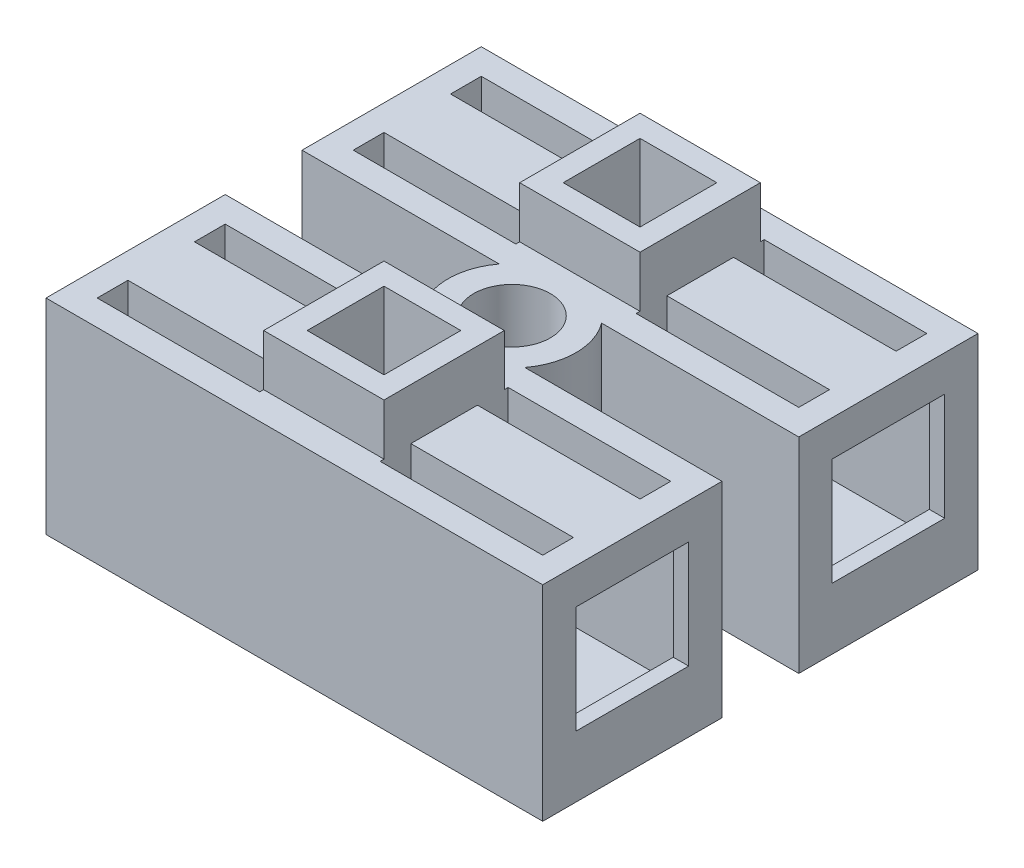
from build123d import *

# Parameters (mm, degrees)
SKETCH1_W                  = 19.4
SKETCH1_H                  = 7
BOSS_EXTRUDE1_DEPTH        = 4
SKETCH3_W                  = 5
SKETCH3_H                  = 5.6
METAL_BODY_PLACEMENT_DEPTH = 14.503332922
SKETCH9_W                  = 4.7
SKETCH9_H                  = 4.7
BOSS_EXTRUDE6_DEPTH        = 2
CUT_EXTRUDE6_REACH         = 18.32
SKETCH10_W                 = 3
SKETCH10_H                 = 3
CUT_EXTRUDE7_REACH         = 17.177
SKETCH4_W                  = 6.35
SKETCH4_H                  = 1.2
MIRROR9_COPY_1_REACH       = 17.177
MIRROR9_COPY_1_SKETCH_W    = 6.35
MIRROR9_COPY_1_SKETCH_H    = 1.2
SKETCH2_W                  = 7
SKETCH2_H                  = 8
SKETCH2_W_2                = 4.4
SKETCH2_H_2                = 4.2
BOSS_EXTRUDE2_DEPTH        = 0.6
SKETCH7_W                  = 17.4
SKETCH7_H                  = 5
CUT_EXTRUDE5_DEPTH         = 0.4
BOSS_EXTRUDE5_START        = -4
SKETCH8_R                  = 2.5
SKETCH8_R_2                = 1.5
BOSS_EXTRUDE5_DEPTH        = 8
MIRROR7_COPY_1_REACH       = 17.177
MIRROR7_COPY_1_SKETCH_W    = 6.35
MIRROR7_COPY_1_SKETCH_H    = 1.2
MIRROR7_COPY_2_REACH       = 17.177
MIRROR7_COPY_2_SKETCH_W    = 6.35
MIRROR7_COPY_2_SKETCH_H    = 1.2
MIRROR7_COPY_3_REACH       = 17.177
MIRROR7_COPY_3_SKETCH_W    = 6.35
MIRROR7_COPY_3_SKETCH_H    = 1.2


with BuildPart() as part:
    # Sketch1 → Boss-Extrude1 (new, symmetric)
    with BuildSketch(Plane(origin=(0, 0, 0), x_dir=(1, 0, 0), z_dir=(0, 1, 0))):
        with Locations((0, 5)):
            Rectangle(SKETCH1_W, SKETCH1_H)
    boss_extrude1 = extrude(amount=BOSS_EXTRUDE1_DEPTH, both=True)

    # Sketch3 → METAL BODY PLACEMENT (cut, symmetric)
    with BuildSketch(Plane(origin=(0, 0, 0), x_dir=(0, 0, -1), z_dir=(1, 0, 0))):
        with Locations((5, 0)):
            Rectangle(SKETCH3_W, SKETCH3_H)
    metal_body_placement = extrude(amount=METAL_BODY_PLACEMENT_DEPTH, both=True, mode=Mode.SUBTRACT)

    # Sketch9 → Boss-Extrude6 (add)
    with BuildSketch(Plane(origin=(0, 4, 0), x_dir=(1, 0, 0), z_dir=(0, 1, 0))):
        with Locations((0, 5)):
            Rectangle(SKETCH9_W, SKETCH9_H)
    boss_extrude6 = extrude(amount=BOSS_EXTRUDE6_DEPTH)

    # Sketch10 → Cut-Extrude6 (cut, up to next)
    with BuildSketch(Plane(origin=(0, 6, 0), x_dir=(1, 0, 0), z_dir=(0, 1, 0)), mode=Mode.PRIVATE) as cut_extrude6_sk1:
        with Locations((0, 5)):
            Rectangle(SKETCH10_W, SKETCH10_H)
    cut_extrude6_tool1 = extrude(cut_extrude6_sk1.sketch, amount=-CUT_EXTRUDE6_REACH, mode=Mode.PRIVATE) & part.part
    cut_extrude6 = cut_extrude6_tool1.solids().sort_by_distance((0, 6, -5))[0]
    add(cut_extrude6, mode=Mode.SUBTRACT)

    # Sketch4 → Cut-Extrude7 (cut, up to next)
    with BuildSketch(Plane(origin=(0, 4, 0), x_dir=(1, 0, 0), z_dir=(0, 1, 0)), mode=Mode.PRIVATE) as cut_extrude7_sk1:
        with Locations((-5.525, 6.9)):
            Rectangle(SKETCH4_W, SKETCH4_H)
    cut_extrude7_tool1 = extrude(cut_extrude7_sk1.sketch, amount=-CUT_EXTRUDE7_REACH, mode=Mode.PRIVATE) & part.part
    cut_extrude7 = cut_extrude7_tool1.solids().sort_by_distance((-5.525, 4, -6.9))[0]
    add(cut_extrude7, mode=Mode.SUBTRACT)

    # Mirror8: Cut-Extrude7 across plane
    add(cut_extrude7.mirror(Plane.XY.offset(-5)), mode=Mode.SUBTRACT)

    # Mirror9: Cut-Extrude7 across plane
    add(cut_extrude7.mirror(Plane(origin=(0, 0, 0), x_dir=(0, 0, 1), z_dir=(1, 0, 0))), mode=Mode.SUBTRACT)

    # Mirror9 copy 1 sketch → Mirror9 copy 1 (cut, up to next)
    with BuildSketch(Plane(origin=(0, 4, -10), x_dir=(-1, 0, 0), z_dir=(0, 1, 0)), mode=Mode.PRIVATE) as mirror9_copy_1_sk1:
        with Locations((-5.525, 6.9)):
            Rectangle(MIRROR9_COPY_1_SKETCH_W, MIRROR9_COPY_1_SKETCH_H)
    mirror9_copy_1_tool1 = extrude(mirror9_copy_1_sk1.sketch, amount=-MIRROR9_COPY_1_REACH, mode=Mode.PRIVATE) & part.part
    add(mirror9_copy_1_tool1.solids().sort_by_distance((5.525, 4, -3.1))[0], mode=Mode.SUBTRACT)

    # Sketch2 → Boss-Extrude2 (add)
    with BuildSketch(Plane(origin=(9.7, 0, 0), x_dir=(0, 0, -1), z_dir=(1, 0, 0))):
        with Locations((5, 0)):
            Rectangle(SKETCH2_W, SKETCH2_H)
        with Locations((5, 0.5)):
            Rectangle(SKETCH2_W_2, SKETCH2_H_2, mode=Mode.SUBTRACT)
    boss_extrude2 = extrude(amount=-BOSS_EXTRUDE2_DEPTH)

    # Sketch7 → Cut-Extrude5 (cut)
    with BuildSketch(Plane.XZ.offset(4)):
        with Locations((0, -5)):
            Rectangle(SKETCH7_W, SKETCH7_H)
    cut_extrude5 = extrude(amount=-CUT_EXTRUDE5_DEPTH, mode=Mode.SUBTRACT)

    # Sketch8 → Boss-Extrude5 (add)
    with BuildSketch(Plane(origin=(0, 0, 0), x_dir=(1, 0, 0), z_dir=(0, 1, 0)).offset(BOSS_EXTRUDE5_START)):
        Circle(SKETCH8_R)
        with Locations(Location((0, 0, 0), (0, 0, 270))):
            Circle(SKETCH8_R_2, mode=Mode.SUBTRACT)
    extrude(amount=BOSS_EXTRUDE5_DEPTH)

    # Mirror7: Boss-Extrude1, METAL BODY PLACEMENT, Boss-Extrude6, Cut-Extrude6, Cut-Extrude7, Boss-Extrude2, Cut-Extrude5 across plane
    add(boss_extrude1.mirror(Plane.XY))
    add(metal_body_placement.mirror(Plane.XY), mode=Mode.SUBTRACT)
    add(boss_extrude6.mirror(Plane.XY))
    add(cut_extrude6.mirror(Plane.XY), mode=Mode.SUBTRACT)
    add(cut_extrude7.mirror(Plane.XY), mode=Mode.SUBTRACT)
    add(boss_extrude2.mirror(Plane.XY))
    add(cut_extrude5.mirror(Plane.XY), mode=Mode.SUBTRACT)

    # Mirror7 copy 1 sketch → Mirror7 copy 1 (cut, up to next)
    with BuildSketch(Plane(origin=(0, 4, 10), x_dir=(1, 0, 0), z_dir=(0, 1, 0)), mode=Mode.PRIVATE) as mirror7_copy_1_sk1:
        with Locations((-5.525, 6.9)):
            Rectangle(MIRROR7_COPY_1_SKETCH_W, MIRROR7_COPY_1_SKETCH_H)
    mirror7_copy_1_tool1 = extrude(mirror7_copy_1_sk1.sketch, amount=-MIRROR7_COPY_1_REACH, mode=Mode.PRIVATE) & part.part
    add(mirror7_copy_1_tool1.solids().sort_by_distance((-5.525, 4, 3.1))[0], mode=Mode.SUBTRACT)

    # Mirror7 copy 2 sketch → Mirror7 copy 2 (cut, up to next)
    with BuildSketch(Plane(origin=(0, 4, 0), x_dir=(-1, 0, 0), z_dir=(0, 1, 0)), mode=Mode.PRIVATE) as mirror7_copy_2_sk1:
        with Locations((-5.525, 6.9)):
            Rectangle(MIRROR7_COPY_2_SKETCH_W, MIRROR7_COPY_2_SKETCH_H)
    mirror7_copy_2_tool1 = extrude(mirror7_copy_2_sk1.sketch, amount=-MIRROR7_COPY_2_REACH, mode=Mode.PRIVATE) & part.part
    add(mirror7_copy_2_tool1.solids().sort_by_distance((5.525, 4, 6.9))[0], mode=Mode.SUBTRACT)

    # Mirror7 copy 3 sketch → Mirror7 copy 3 (cut, up to next)
    with BuildSketch(Plane(origin=(0, 4, 10), x_dir=(-1, 0, 0), z_dir=(0, 1, 0)), mode=Mode.PRIVATE) as mirror7_copy_3_sk1:
        with Locations((-5.525, -6.9)):
            Rectangle(MIRROR7_COPY_3_SKETCH_W, MIRROR7_COPY_3_SKETCH_H)
    mirror7_copy_3_tool1 = extrude(mirror7_copy_3_sk1.sketch, amount=-MIRROR7_COPY_3_REACH, mode=Mode.PRIVATE) & part.part
    add(mirror7_copy_3_tool1.solids().sort_by_distance((5.525, 4, 3.1))[0], mode=Mode.SUBTRACT)


solid = part.part
